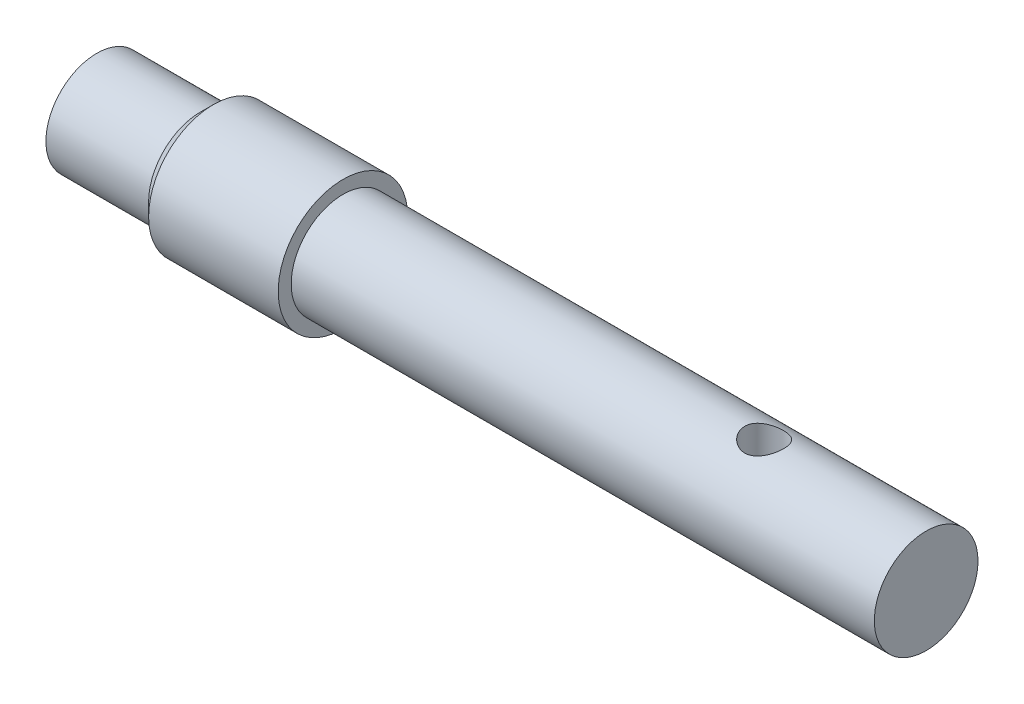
from build123d import *

# Parameters (mm, degrees)
CHANFREIN2_SIZE              = 1
ENL_V_MAT_EXTRU_2_DEPTH      = 57.444663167
ENL_V_MAT_EXTRU_2_DEPTH_BACK = 57.444663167
ESQUISSE3_R                  = 1.5


with BuildPart() as part:
    # Esquisse1 → Base-R_volution (revolve)
    with BuildSketch(Plane.XY, mode=Mode.PRIVATE) as base_r_volution_sk:
        Polygon((-8, 3.866390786), (-3.901290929, 1.5), (-0.901290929, 1.5), (0, 0), (56, 0), (56, 4), (11, 4), (11, 5), (0, 5), (0, 3.925), (-8, 3.925), align=None)
    revolve(base_r_volution_sk.sketch.rotate(Axis((0, 0, 0), (-1, 0, 0)), 90), axis=Axis((0, 0, 0), (-1, 0, 0)))

    # Chanfrein2
    chanfrein2_edges = [part.edges().sort_by_distance(p)[0] for p in [
        (0, 0, 5),
    ]]
    chamfer(chanfrein2_edges, length=CHANFREIN2_SIZE)

    # Esquisse3 → Enl_v. mat.-Extru.2 (cut, two sides: drawn at the far end of the back side and taken through both)
    with BuildSketch(Plane(origin=(0, 0, 0), x_dir=(1, 0, 0), z_dir=(0, 1, 0)).offset(-ENL_V_MAT_EXTRU_2_DEPTH_BACK)):
        with Locations(Location((43.5, 0, 0), (0, 0, 270))):
            Circle(ESQUISSE3_R)
    extrude(amount=ENL_V_MAT_EXTRU_2_DEPTH + ENL_V_MAT_EXTRU_2_DEPTH_BACK, mode=Mode.SUBTRACT)


solid = part.part
